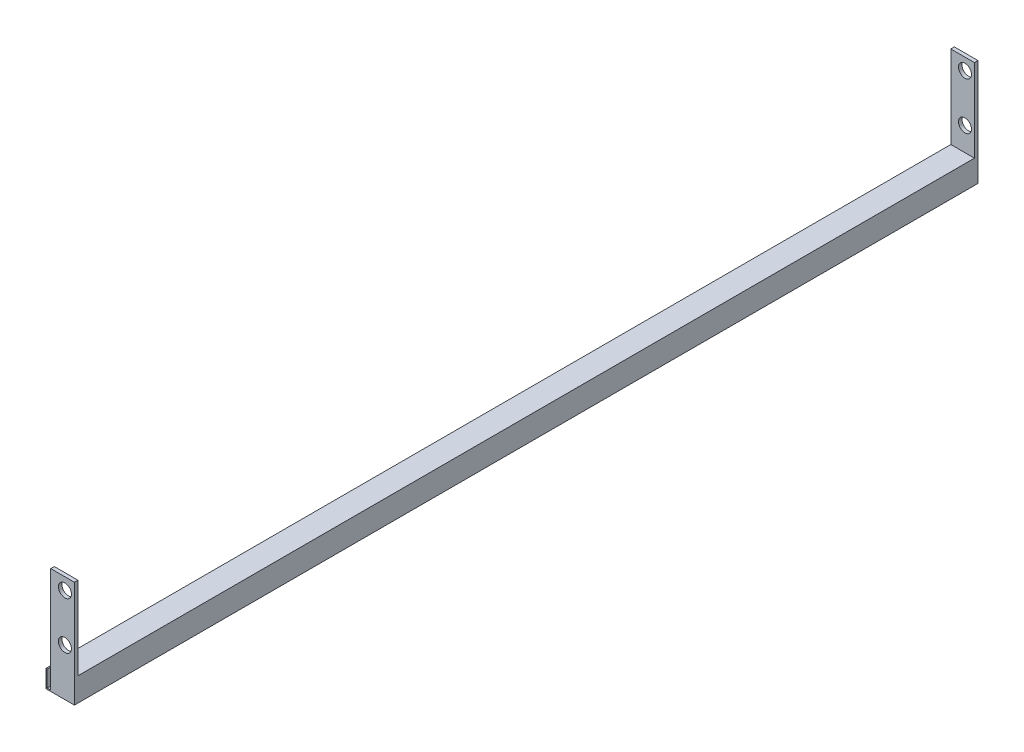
ISO-10303-21;
HEADER;
FILE_DESCRIPTION(('STEP AP214'),'2;1');
FILE_NAME('part.step','',(''),(''),'','','');
FILE_SCHEMA(('AUTOMOTIVE_DESIGN { 1 0 10303 214 1 1 1 1 }'));
ENDSEC;
DATA;
#1=APPLICATION_CONTEXT('core data for automotive mechanical design processes');
#2=APPLICATION_PROTOCOL_DEFINITION('international standard','automotive_design',2000,#1);
#3=PRODUCT_CONTEXT('',#1,'mechanical');
#4=PRODUCT('Part','Part','',(#3));
#5=PRODUCT_RELATED_PRODUCT_CATEGORY('part','',(#4));
#6=PRODUCT_DEFINITION_FORMATION('','',#4);
#7=PRODUCT_DEFINITION_CONTEXT('part definition',#1,'design');
#8=PRODUCT_DEFINITION('design','',#6,#7);
#9=PRODUCT_DEFINITION_SHAPE('','',#8);
#10=(LENGTH_UNIT() NAMED_UNIT(*) SI_UNIT(.MILLI.,.METRE.));
#11=(NAMED_UNIT(*) PLANE_ANGLE_UNIT() SI_UNIT($,.RADIAN.));
#12=(NAMED_UNIT(*) SI_UNIT($,.STERADIAN.) SOLID_ANGLE_UNIT());
#13=UNCERTAINTY_MEASURE_WITH_UNIT(LENGTH_MEASURE(1.E-05),#10,'distance_accuracy_value','');
#14=(GEOMETRIC_REPRESENTATION_CONTEXT(3) GLOBAL_UNCERTAINTY_ASSIGNED_CONTEXT((#13)) GLOBAL_UNIT_ASSIGNED_CONTEXT((#10,
#11,#12)) REPRESENTATION_CONTEXT('',''));
#15=CARTESIAN_POINT('',(0.,0.,0.));
#16=DIRECTION('',(0.,0.,1.));
#17=DIRECTION('',(1.,0.,0.));
#18=AXIS2_PLACEMENT_3D('',#15,#16,#17);
#19=CARTESIAN_POINT('',(0.,0.,758.));
#20=DIRECTION('',(1.,0.,0.));
#21=DIRECTION('',(0.,0.,-1.));
#22=AXIS2_PLACEMENT_3D('',#19,#20,#21);
#23=PLANE('',#22);
#24=DIRECTION('',(0.,0.,-1.));
#25=VECTOR('',#24,1.);
#26=CARTESIAN_POINT('',(0.,1.,776.52417469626));
#27=LINE('',#26,#25);
#28=CARTESIAN_POINT('',(0.,0.999999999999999,761.));
#29=VERTEX_POINT('',#28);
#30=CARTESIAN_POINT('',(0.,1.,-3.));
#31=VERTEX_POINT('',#30);
#32=EDGE_CURVE('E44',#29,#31,#27,.T.);
#33=ORIENTED_EDGE('',*,*,#32,.F.);
#34=DIRECTION('',(0.,-1.,0.));
#35=VECTOR('',#34,1.);
#36=CARTESIAN_POINT('',(0.,0.,761.));
#37=LINE('',#36,#35);
#38=CARTESIAN_POINT('',(0.,90.,761.));
#39=VERTEX_POINT('',#38);
#40=EDGE_CURVE('E155',#39,#29,#37,.T.);
#41=ORIENTED_EDGE('',*,*,#40,.F.);
#42=DIRECTION('',(0.,0.,-1.));
#43=VECTOR('',#42,1.);
#44=CARTESIAN_POINT('',(0.,90.,761.));
#45=LINE('',#44,#43);
#46=CARTESIAN_POINT('',(0.,90.,758.));
#47=VERTEX_POINT('',#46);
#48=EDGE_CURVE('E154',#39,#47,#45,.T.);
#49=ORIENTED_EDGE('',*,*,#48,.T.);
#50=DIRECTION('',(0.,-1.,0.));
#51=VECTOR('',#50,1.);
#52=CARTESIAN_POINT('',(0.,0.,758.));
#53=LINE('',#52,#51);
#54=CARTESIAN_POINT('',(0.,20.,758.));
#55=VERTEX_POINT('',#54);
#56=EDGE_CURVE('E223',#47,#55,#53,.T.);
#57=ORIENTED_EDGE('',*,*,#56,.T.);
#58=DIRECTION('',(0.,0.,-1.));
#59=VECTOR('',#58,1.);
#60=CARTESIAN_POINT('',(0.,20.,758.));
#61=LINE('',#60,#59);
#62=CARTESIAN_POINT('',(0.,20.,0.));
#63=VERTEX_POINT('',#62);
#64=EDGE_CURVE('E286',#55,#63,#61,.T.);
#65=ORIENTED_EDGE('',*,*,#64,.T.);
#66=DIRECTION('',(0.,1.,0.));
#67=VECTOR('',#66,1.);
#68=CARTESIAN_POINT('',(0.,0.,0.));
#69=LINE('',#68,#67);
#70=CARTESIAN_POINT('',(0.,90.,0.));
#71=VERTEX_POINT('',#70);
#72=EDGE_CURVE('E190',#63,#71,#69,.T.);
#73=ORIENTED_EDGE('',*,*,#72,.T.);
#74=DIRECTION('',(0.,0.,1.));
#75=VECTOR('',#74,1.);
#76=CARTESIAN_POINT('',(0.,90.,-3.));
#77=LINE('',#76,#75);
#78=CARTESIAN_POINT('',(0.,90.,-3.));
#79=VERTEX_POINT('',#78);
#80=EDGE_CURVE('E204',#79,#71,#77,.T.);
#81=ORIENTED_EDGE('',*,*,#80,.F.);
#82=DIRECTION('',(0.,1.,0.));
#83=VECTOR('',#82,1.);
#84=CARTESIAN_POINT('',(0.,0.,-3.));
#85=LINE('',#84,#83);
#86=EDGE_CURVE('E237',#31,#79,#85,.T.);
#87=ORIENTED_EDGE('',*,*,#86,.F.);
#88=EDGE_LOOP('',(#33,#41,#49,#57,#65,#73,#81,#87));
#89=FACE_BOUND('',#88,.T.);
#90=ADVANCED_FACE('F27',(#89),#23,.F.);
#91=CARTESIAN_POINT('',(0.,0.,758.));
#92=DIRECTION('',(0.,1.,0.));
#93=DIRECTION('',(0.,0.,1.));
#94=AXIS2_PLACEMENT_3D('',#91,#92,#93);
#95=PLANE('',#94);
#96=DIRECTION('',(1.,0.,0.));
#97=VECTOR('',#96,1.);
#98=CARTESIAN_POINT('',(20.,0.,761.));
#99=LINE('',#98,#97);
#100=CARTESIAN_POINT('',(-4.,0.,761.));
#101=VERTEX_POINT('',#100);
#102=CARTESIAN_POINT('',(20.,0.,761.));
#103=VERTEX_POINT('',#102);
#104=EDGE_CURVE('E144',#101,#103,#99,.T.);
#105=ORIENTED_EDGE('',*,*,#104,.F.);
#106=DIRECTION('',(0.,0.,-1.));
#107=VECTOR('',#106,1.);
#108=CARTESIAN_POINT('',(-4.,0.,776.52417469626));
#109=LINE('',#108,#107);
#110=CARTESIAN_POINT('',(-4.,0.,-3.));
#111=VERTEX_POINT('',#110);
#112=EDGE_CURVE('E149',#101,#111,#109,.T.);
#113=ORIENTED_EDGE('',*,*,#112,.T.);
#114=DIRECTION('',(-1.,0.,0.));
#115=VECTOR('',#114,1.);
#116=CARTESIAN_POINT('',(20.,0.,-3.));
#117=LINE('',#116,#115);
#118=CARTESIAN_POINT('',(20.,0.,-3.));
#119=VERTEX_POINT('',#118);
#120=EDGE_CURVE('E350',#119,#111,#117,.T.);
#121=ORIENTED_EDGE('',*,*,#120,.F.);
#122=DIRECTION('',(0.,0.,-1.));
#123=VECTOR('',#122,1.);
#124=CARTESIAN_POINT('',(20.,0.,758.));
#125=LINE('',#124,#123);
#126=EDGE_CURVE('E11',#103,#119,#125,.T.);
#127=ORIENTED_EDGE('',*,*,#126,.F.);
#128=EDGE_LOOP('',(#105,#113,#121,#127));
#129=FACE_BOUND('',#128,.T.);
#130=ADVANCED_FACE('F146',(#129),#95,.F.);
#131=CARTESIAN_POINT('',(20.,0.,758.));
#132=DIRECTION('',(-1.,0.,0.));
#133=DIRECTION('',(0.,0.,1.));
#134=AXIS2_PLACEMENT_3D('',#131,#132,#133);
#135=PLANE('',#134);
#136=ORIENTED_EDGE('',*,*,#126,.T.);
#137=DIRECTION('',(0.,-1.,0.));
#138=VECTOR('',#137,1.);
#139=CARTESIAN_POINT('',(20.,90.,-3.));
#140=LINE('',#139,#138);
#141=CARTESIAN_POINT('',(20.,90.,-3.));
#142=VERTEX_POINT('',#141);
#143=EDGE_CURVE('E357',#142,#119,#140,.T.);
#144=ORIENTED_EDGE('',*,*,#143,.F.);
#145=DIRECTION('',(0.,0.,1.));
#146=VECTOR('',#145,1.);
#147=CARTESIAN_POINT('',(20.,90.,-3.));
#148=LINE('',#147,#146);
#149=CARTESIAN_POINT('',(20.,90.,0.));
#150=VERTEX_POINT('',#149);
#151=EDGE_CURVE('E347',#142,#150,#148,.T.);
#152=ORIENTED_EDGE('',*,*,#151,.T.);
#153=DIRECTION('',(0.,-1.,0.));
#154=VECTOR('',#153,1.);
#155=CARTESIAN_POINT('',(20.,90.,0.));
#156=LINE('',#155,#154);
#157=CARTESIAN_POINT('',(20.,20.0000000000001,0.));
#158=VERTEX_POINT('',#157);
#159=EDGE_CURVE('E198',#150,#158,#156,.T.);
#160=ORIENTED_EDGE('',*,*,#159,.T.);
#161=DIRECTION('',(0.,0.,-1.));
#162=VECTOR('',#161,1.);
#163=CARTESIAN_POINT('',(20.,20.,758.));
#164=LINE('',#163,#162);
#165=CARTESIAN_POINT('',(20.,20.,758.));
#166=VERTEX_POINT('',#165);
#167=EDGE_CURVE('E36',#166,#158,#164,.T.);
#168=ORIENTED_EDGE('',*,*,#167,.F.);
#169=DIRECTION('',(0.,1.,0.));
#170=VECTOR('',#169,1.);
#171=CARTESIAN_POINT('',(20.,0.,758.));
#172=LINE('',#171,#170);
#173=CARTESIAN_POINT('',(20.,90.,758.));
#174=VERTEX_POINT('',#173);
#175=EDGE_CURVE('E213',#166,#174,#172,.T.);
#176=ORIENTED_EDGE('',*,*,#175,.T.);
#177=DIRECTION('',(0.,0.,-1.));
#178=VECTOR('',#177,1.);
#179=CARTESIAN_POINT('',(20.,90.,761.));
#180=LINE('',#179,#178);
#181=CARTESIAN_POINT('',(20.,90.,761.));
#182=VERTEX_POINT('',#181);
#183=EDGE_CURVE('E221',#182,#174,#180,.T.);
#184=ORIENTED_EDGE('',*,*,#183,.F.);
#185=DIRECTION('',(0.,1.,0.));
#186=VECTOR('',#185,1.);
#187=CARTESIAN_POINT('',(20.,0.,761.));
#188=LINE('',#187,#186);
#189=EDGE_CURVE('E226',#103,#182,#188,.T.);
#190=ORIENTED_EDGE('',*,*,#189,.F.);
#191=EDGE_LOOP('',(#136,#144,#152,#160,#168,#176,#184,#190));
#192=FACE_BOUND('',#191,.T.);
#193=ADVANCED_FACE('F333',(#192),#135,.F.);
#194=CARTESIAN_POINT('',(0.,20.,758.));
#195=DIRECTION('',(0.,-1.,0.));
#196=DIRECTION('',(0.,0.,-1.));
#197=AXIS2_PLACEMENT_3D('',#194,#195,#196);
#198=PLANE('',#197);
#199=DIRECTION('',(-1.,0.,0.));
#200=VECTOR('',#199,1.);
#201=CARTESIAN_POINT('',(0.,20.,0.));
#202=LINE('',#201,#200);
#203=EDGE_CURVE('E287',#158,#63,#202,.T.);
#204=ORIENTED_EDGE('',*,*,#203,.T.);
#205=ORIENTED_EDGE('',*,*,#64,.F.);
#206=DIRECTION('',(-1.,0.,0.));
#207=VECTOR('',#206,1.);
#208=CARTESIAN_POINT('',(0.,20.,758.));
#209=LINE('',#208,#207);
#210=EDGE_CURVE('E283',#166,#55,#209,.T.);
#211=ORIENTED_EDGE('',*,*,#210,.F.);
#212=ORIENTED_EDGE('',*,*,#167,.T.);
#213=EDGE_LOOP('',(#204,#205,#211,#212));
#214=FACE_BOUND('',#213,.T.);
#215=ADVANCED_FACE('F337',(#214),#198,.F.);
#216=CARTESIAN_POINT('',(20.,90.,758.));
#217=DIRECTION('',(0.,0.,1.));
#218=DIRECTION('',(1.,0.,0.));
#219=AXIS2_PLACEMENT_3D('',#216,#217,#218);
#220=PLANE('',#219);
#221=CARTESIAN_POINT('',(12.,80.,758.));
#222=DIRECTION('',(0.,0.,1.));
#223=DIRECTION('',(1.,0.,0.));
#224=AXIS2_PLACEMENT_3D('',#221,#222,#223);
#225=CIRCLE('',#224,5.5);
#226=CARTESIAN_POINT('',(17.5,80.,758.));
#227=VERTEX_POINT('',#226);
#228=EDGE_CURVE('E207',#227,#227,#225,.T.);
#229=ORIENTED_EDGE('',*,*,#228,.T.);
#230=EDGE_LOOP('',(#229));
#231=FACE_BOUND('',#230,.T.);
#232=CARTESIAN_POINT('',(12.,40.,758.));
#233=DIRECTION('',(0.,0.,1.));
#234=DIRECTION('',(1.,0.,0.));
#235=AXIS2_PLACEMENT_3D('',#232,#233,#234);
#236=CIRCLE('',#235,5.5);
#237=CARTESIAN_POINT('',(17.5,40.,758.));
#238=VERTEX_POINT('',#237);
#239=EDGE_CURVE('E200',#238,#238,#236,.T.);
#240=ORIENTED_EDGE('',*,*,#239,.T.);
#241=EDGE_LOOP('',(#240));
#242=FACE_BOUND('',#241,.T.);
#243=ORIENTED_EDGE('',*,*,#175,.F.);
#244=ORIENTED_EDGE('',*,*,#210,.T.);
#245=ORIENTED_EDGE('',*,*,#56,.F.);
#246=DIRECTION('',(-1.,0.,0.));
#247=VECTOR('',#246,1.);
#248=CARTESIAN_POINT('',(20.,90.,758.));
#249=LINE('',#248,#247);
#250=EDGE_CURVE('E216',#174,#47,#249,.T.);
#251=ORIENTED_EDGE('',*,*,#250,.F.);
#252=EDGE_LOOP('',(#243,#244,#245,#251));
#253=FACE_BOUND('',#252,.T.);
#254=ADVANCED_FACE('F280',(#231,#242,#253),#220,.F.);
#255=CARTESIAN_POINT('',(20.,90.,761.));
#256=DIRECTION('',(0.,0.,1.));
#257=DIRECTION('',(1.,0.,0.));
#258=AXIS2_PLACEMENT_3D('',#255,#256,#257);
#259=PLANE('',#258);
#260=CARTESIAN_POINT('',(12.,80.,761.));
#261=DIRECTION('',(0.,0.,1.));
#262=DIRECTION('',(1.,0.,0.));
#263=AXIS2_PLACEMENT_3D('',#260,#261,#262);
#264=CIRCLE('',#263,5.5);
#265=CARTESIAN_POINT('',(17.5,80.,761.));
#266=VERTEX_POINT('',#265);
#267=EDGE_CURVE('E210',#266,#266,#264,.T.);
#268=ORIENTED_EDGE('',*,*,#267,.F.);
#269=EDGE_LOOP('',(#268));
#270=FACE_BOUND('',#269,.T.);
#271=ORIENTED_EDGE('',*,*,#189,.T.);
#272=DIRECTION('',(-1.,0.,0.));
#273=VECTOR('',#272,1.);
#274=CARTESIAN_POINT('',(20.,90.,761.));
#275=LINE('',#274,#273);
#276=EDGE_CURVE('E231',#182,#39,#275,.T.);
#277=ORIENTED_EDGE('',*,*,#276,.T.);
#278=ORIENTED_EDGE('',*,*,#40,.T.);
#279=DIRECTION('',(1.,0.,0.));
#280=VECTOR('',#279,1.);
#281=CARTESIAN_POINT('',(0.,1.,761.));
#282=LINE('',#281,#280);
#283=CARTESIAN_POINT('',(-3.,1.,761.));
#284=VERTEX_POINT('',#283);
#285=EDGE_CURVE('E241',#284,#29,#282,.T.);
#286=ORIENTED_EDGE('',*,*,#285,.F.);
#287=DIRECTION('',(0.,-1.,0.));
#288=VECTOR('',#287,1.);
#289=CARTESIAN_POINT('',(-3.,1.,761.));
#290=LINE('',#289,#288);
#291=CARTESIAN_POINT('',(-3.,15.,761.));
#292=VERTEX_POINT('',#291);
#293=EDGE_CURVE('E247',#292,#284,#290,.T.);
#294=ORIENTED_EDGE('',*,*,#293,.F.);
#295=DIRECTION('',(1.,0.,0.));
#296=VECTOR('',#295,1.);
#297=CARTESIAN_POINT('',(-3.,15.,761.));
#298=LINE('',#297,#296);
#299=CARTESIAN_POINT('',(-4.,15.,761.));
#300=VERTEX_POINT('',#299);
#301=EDGE_CURVE('E162',#300,#292,#298,.T.);
#302=ORIENTED_EDGE('',*,*,#301,.F.);
#303=DIRECTION('',(0.,1.,0.));
#304=VECTOR('',#303,1.);
#305=CARTESIAN_POINT('',(-4.,0.,761.));
#306=LINE('',#305,#304);
#307=EDGE_CURVE('E158',#101,#300,#306,.T.);
#308=ORIENTED_EDGE('',*,*,#307,.F.);
#309=ORIENTED_EDGE('',*,*,#104,.T.);
#310=EDGE_LOOP('',(#271,#277,#278,#286,#294,#302,#308,#309));
#311=FACE_BOUND('',#310,.T.);
#312=CARTESIAN_POINT('',(12.,40.,761.));
#313=DIRECTION('',(0.,0.,1.));
#314=DIRECTION('',(1.,0.,0.));
#315=AXIS2_PLACEMENT_3D('',#312,#313,#314);
#316=CIRCLE('',#315,5.5);
#317=CARTESIAN_POINT('',(17.5,40.,761.));
#318=VERTEX_POINT('',#317);
#319=EDGE_CURVE('E203',#318,#318,#316,.T.);
#320=ORIENTED_EDGE('',*,*,#319,.F.);
#321=EDGE_LOOP('',(#320));
#322=FACE_BOUND('',#321,.T.);
#323=ADVANCED_FACE('F159',(#270,#311,#322),#259,.T.);
#324=CARTESIAN_POINT('',(20.,90.,761.));
#325=DIRECTION('',(0.,-1.,0.));
#326=DIRECTION('',(0.,0.,-1.));
#327=AXIS2_PLACEMENT_3D('',#324,#325,#326);
#328=PLANE('',#327);
#329=ORIENTED_EDGE('',*,*,#250,.T.);
#330=ORIENTED_EDGE('',*,*,#48,.F.);
#331=ORIENTED_EDGE('',*,*,#276,.F.);
#332=ORIENTED_EDGE('',*,*,#183,.T.);
#333=EDGE_LOOP('',(#329,#330,#331,#332));
#334=FACE_BOUND('',#333,.T.);
#335=ADVANCED_FACE('F331',(#334),#328,.F.);
#336=CARTESIAN_POINT('',(12.,80.,761.));
#337=DIRECTION('',(0.,0.,-1.));
#338=DIRECTION('',(-1.,0.,0.));
#339=AXIS2_PLACEMENT_3D('',#336,#337,#338);
#340=CYLINDRICAL_SURFACE('',#339,5.5);
#341=ORIENTED_EDGE('',*,*,#267,.T.);
#342=EDGE_LOOP('',(#341));
#343=FACE_BOUND('',#342,.T.);
#344=ORIENTED_EDGE('',*,*,#228,.F.);
#345=EDGE_LOOP('',(#344));
#346=FACE_BOUND('',#345,.T.);
#347=ADVANCED_FACE('F412',(#343,#346),#340,.F.);
#348=CARTESIAN_POINT('',(12.,40.,761.));
#349=DIRECTION('',(0.,0.,-1.));
#350=DIRECTION('',(-1.,0.,0.));
#351=AXIS2_PLACEMENT_3D('',#348,#349,#350);
#352=CYLINDRICAL_SURFACE('',#351,5.5);
#353=ORIENTED_EDGE('',*,*,#319,.T.);
#354=EDGE_LOOP('',(#353));
#355=FACE_BOUND('',#354,.T.);
#356=ORIENTED_EDGE('',*,*,#239,.F.);
#357=EDGE_LOOP('',(#356));
#358=FACE_BOUND('',#357,.T.);
#359=ADVANCED_FACE('F420',(#355,#358),#352,.F.);
#360=CARTESIAN_POINT('',(0.,0.,-3.));
#361=DIRECTION('',(0.,0.,-1.));
#362=DIRECTION('',(-1.,0.,0.));
#363=AXIS2_PLACEMENT_3D('',#360,#361,#362);
#364=PLANE('',#363);
#365=CARTESIAN_POINT('',(12.,40.,-3.));
#366=DIRECTION('',(0.,0.,-1.));
#367=DIRECTION('',(-1.,0.,0.));
#368=AXIS2_PLACEMENT_3D('',#365,#366,#367);
#369=CIRCLE('',#368,5.5);
#370=CARTESIAN_POINT('',(6.50000000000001,40.,-3.));
#371=VERTEX_POINT('',#370);
#372=EDGE_CURVE('E187',#371,#371,#369,.T.);
#373=ORIENTED_EDGE('',*,*,#372,.F.);
#374=EDGE_LOOP('',(#373));
#375=FACE_BOUND('',#374,.T.);
#376=ORIENTED_EDGE('',*,*,#120,.T.);
#377=DIRECTION('',(0.,1.,0.));
#378=VECTOR('',#377,1.);
#379=CARTESIAN_POINT('',(-4.,0.,-3.));
#380=LINE('',#379,#378);
#381=CARTESIAN_POINT('',(-4.,15.,-3.));
#382=VERTEX_POINT('',#381);
#383=EDGE_CURVE('E169',#111,#382,#380,.T.);
#384=ORIENTED_EDGE('',*,*,#383,.T.);
#385=DIRECTION('',(1.,0.,0.));
#386=VECTOR('',#385,1.);
#387=CARTESIAN_POINT('',(-3.,15.,-3.));
#388=LINE('',#387,#386);
#389=CARTESIAN_POINT('',(-3.,15.,-3.));
#390=VERTEX_POINT('',#389);
#391=EDGE_CURVE('E257',#382,#390,#388,.T.);
#392=ORIENTED_EDGE('',*,*,#391,.T.);
#393=DIRECTION('',(0.,-1.,0.));
#394=VECTOR('',#393,1.);
#395=CARTESIAN_POINT('',(-3.,1.,-3.));
#396=LINE('',#395,#394);
#397=CARTESIAN_POINT('',(-3.,1.,-3.));
#398=VERTEX_POINT('',#397);
#399=EDGE_CURVE('E173',#390,#398,#396,.T.);
#400=ORIENTED_EDGE('',*,*,#399,.T.);
#401=DIRECTION('',(1.,0.,0.));
#402=VECTOR('',#401,1.);
#403=CARTESIAN_POINT('',(0.,1.,-3.));
#404=LINE('',#403,#402);
#405=EDGE_CURVE('E170',#398,#31,#404,.T.);
#406=ORIENTED_EDGE('',*,*,#405,.T.);
#407=ORIENTED_EDGE('',*,*,#86,.T.);
#408=DIRECTION('',(1.,0.,0.));
#409=VECTOR('',#408,1.);
#410=CARTESIAN_POINT('',(0.,90.,-3.));
#411=LINE('',#410,#409);
#412=EDGE_CURVE('E346',#79,#142,#411,.T.);
#413=ORIENTED_EDGE('',*,*,#412,.T.);
#414=ORIENTED_EDGE('',*,*,#143,.T.);
#415=EDGE_LOOP('',(#376,#384,#392,#400,#406,#407,#413,#414));
#416=FACE_BOUND('',#415,.T.);
#417=CARTESIAN_POINT('',(12.,80.,-3.));
#418=DIRECTION('',(0.,0.,-1.));
#419=DIRECTION('',(-1.,0.,0.));
#420=AXIS2_PLACEMENT_3D('',#417,#418,#419);
#421=CIRCLE('',#420,5.50000000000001);
#422=CARTESIAN_POINT('',(6.49999999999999,80.,-3.));
#423=VERTEX_POINT('',#422);
#424=EDGE_CURVE('E181',#423,#423,#421,.T.);
#425=ORIENTED_EDGE('',*,*,#424,.F.);
#426=EDGE_LOOP('',(#425));
#427=FACE_BOUND('',#426,.T.);
#428=ADVANCED_FACE('F263',(#375,#416,#427),#364,.T.);
#429=CARTESIAN_POINT('',(0.,0.,0.));
#430=DIRECTION('',(0.,0.,-1.));
#431=DIRECTION('',(-1.,0.,0.));
#432=AXIS2_PLACEMENT_3D('',#429,#430,#431);
#433=PLANE('',#432);
#434=ORIENTED_EDGE('',*,*,#203,.F.);
#435=ORIENTED_EDGE('',*,*,#159,.F.);
#436=DIRECTION('',(1.,0.,0.));
#437=VECTOR('',#436,1.);
#438=CARTESIAN_POINT('',(0.,90.,0.));
#439=LINE('',#438,#437);
#440=EDGE_CURVE('E193',#71,#150,#439,.T.);
#441=ORIENTED_EDGE('',*,*,#440,.F.);
#442=ORIENTED_EDGE('',*,*,#72,.F.);
#443=EDGE_LOOP('',(#434,#435,#441,#442));
#444=FACE_BOUND('',#443,.T.);
#445=CARTESIAN_POINT('',(12.,40.,0.));
#446=DIRECTION('',(0.,0.,-1.));
#447=DIRECTION('',(-1.,0.,0.));
#448=AXIS2_PLACEMENT_3D('',#445,#446,#447);
#449=CIRCLE('',#448,5.5);
#450=CARTESIAN_POINT('',(6.50000000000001,40.,0.));
#451=VERTEX_POINT('',#450);
#452=EDGE_CURVE('E184',#451,#451,#449,.T.);
#453=ORIENTED_EDGE('',*,*,#452,.T.);
#454=EDGE_LOOP('',(#453));
#455=FACE_BOUND('',#454,.T.);
#456=CARTESIAN_POINT('',(12.,80.,0.));
#457=DIRECTION('',(0.,0.,-1.));
#458=DIRECTION('',(-1.,0.,0.));
#459=AXIS2_PLACEMENT_3D('',#456,#457,#458);
#460=CIRCLE('',#459,5.50000000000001);
#461=CARTESIAN_POINT('',(6.49999999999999,80.,0.));
#462=VERTEX_POINT('',#461);
#463=EDGE_CURVE('E178',#462,#462,#460,.T.);
#464=ORIENTED_EDGE('',*,*,#463,.T.);
#465=EDGE_LOOP('',(#464));
#466=FACE_BOUND('',#465,.T.);
#467=ADVANCED_FACE('F348',(#444,#455,#466),#433,.F.);
#468=CARTESIAN_POINT('',(0.,90.,-3.));
#469=DIRECTION('',(0.,-1.,0.));
#470=DIRECTION('',(0.,0.,-1.));
#471=AXIS2_PLACEMENT_3D('',#468,#469,#470);
#472=PLANE('',#471);
#473=ORIENTED_EDGE('',*,*,#440,.T.);
#474=ORIENTED_EDGE('',*,*,#151,.F.);
#475=ORIENTED_EDGE('',*,*,#412,.F.);
#476=ORIENTED_EDGE('',*,*,#80,.T.);
#477=EDGE_LOOP('',(#473,#474,#475,#476));
#478=FACE_BOUND('',#477,.T.);
#479=ADVANCED_FACE('F344',(#478),#472,.F.);
#480=CARTESIAN_POINT('',(12.,40.,-3.));
#481=DIRECTION('',(0.,0.,1.));
#482=DIRECTION('',(1.,0.,0.));
#483=AXIS2_PLACEMENT_3D('',#480,#481,#482);
#484=CYLINDRICAL_SURFACE('',#483,5.5);
#485=ORIENTED_EDGE('',*,*,#372,.T.);
#486=EDGE_LOOP('',(#485));
#487=FACE_BOUND('',#486,.T.);
#488=ORIENTED_EDGE('',*,*,#452,.F.);
#489=EDGE_LOOP('',(#488));
#490=FACE_BOUND('',#489,.T.);
#491=ADVANCED_FACE('F369',(#487,#490),#484,.F.);
#492=CARTESIAN_POINT('',(12.,80.,-3.));
#493=DIRECTION('',(0.,0.,1.));
#494=DIRECTION('',(1.,0.,0.));
#495=AXIS2_PLACEMENT_3D('',#492,#493,#494);
#496=CYLINDRICAL_SURFACE('',#495,5.50000000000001);
#497=ORIENTED_EDGE('',*,*,#424,.T.);
#498=EDGE_LOOP('',(#497));
#499=FACE_BOUND('',#498,.T.);
#500=ORIENTED_EDGE('',*,*,#463,.F.);
#501=EDGE_LOOP('',(#500));
#502=FACE_BOUND('',#501,.T.);
#503=ADVANCED_FACE('F367',(#499,#502),#496,.F.);
#504=CARTESIAN_POINT('',(-4.,0.,776.52417469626));
#505=DIRECTION('',(-1.,0.,0.));
#506=DIRECTION('',(0.,0.,1.));
#507=AXIS2_PLACEMENT_3D('',#504,#505,#506);
#508=PLANE('',#507);
#509=ORIENTED_EDGE('',*,*,#112,.F.);
#510=ORIENTED_EDGE('',*,*,#307,.T.);
#511=DIRECTION('',(0.,0.,-1.));
#512=VECTOR('',#511,1.);
#513=CARTESIAN_POINT('',(-4.,15.,776.52417469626));
#514=LINE('',#513,#512);
#515=EDGE_CURVE('E165',#300,#382,#514,.T.);
#516=ORIENTED_EDGE('',*,*,#515,.T.);
#517=ORIENTED_EDGE('',*,*,#383,.F.);
#518=EDGE_LOOP('',(#509,#510,#516,#517));
#519=FACE_BOUND('',#518,.T.);
#520=ADVANCED_FACE('F167',(#519),#508,.T.);
#521=CARTESIAN_POINT('',(-3.,15.,776.52417469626));
#522=DIRECTION('',(0.,1.,0.));
#523=DIRECTION('',(0.,0.,1.));
#524=AXIS2_PLACEMENT_3D('',#521,#522,#523);
#525=PLANE('',#524);
#526=ORIENTED_EDGE('',*,*,#515,.F.);
#527=ORIENTED_EDGE('',*,*,#301,.T.);
#528=DIRECTION('',(0.,0.,-1.));
#529=VECTOR('',#528,1.);
#530=CARTESIAN_POINT('',(-3.,15.,776.52417469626));
#531=LINE('',#530,#529);
#532=EDGE_CURVE('E248',#292,#390,#531,.T.);
#533=ORIENTED_EDGE('',*,*,#532,.T.);
#534=ORIENTED_EDGE('',*,*,#391,.F.);
#535=EDGE_LOOP('',(#526,#527,#533,#534));
#536=FACE_BOUND('',#535,.T.);
#537=ADVANCED_FACE('F377',(#536),#525,.T.);
#538=CARTESIAN_POINT('',(-3.,1.,776.52417469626));
#539=DIRECTION('',(1.,0.,0.));
#540=DIRECTION('',(0.,0.,-1.));
#541=AXIS2_PLACEMENT_3D('',#538,#539,#540);
#542=PLANE('',#541);
#543=ORIENTED_EDGE('',*,*,#532,.F.);
#544=ORIENTED_EDGE('',*,*,#293,.T.);
#545=DIRECTION('',(0.,0.,-1.));
#546=VECTOR('',#545,1.);
#547=CARTESIAN_POINT('',(-3.,1.,776.52417469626));
#548=LINE('',#547,#546);
#549=EDGE_CURVE('E246',#284,#398,#548,.T.);
#550=ORIENTED_EDGE('',*,*,#549,.T.);
#551=ORIENTED_EDGE('',*,*,#399,.F.);
#552=EDGE_LOOP('',(#543,#544,#550,#551));
#553=FACE_BOUND('',#552,.T.);
#554=ADVANCED_FACE('F446',(#553),#542,.T.);
#555=CARTESIAN_POINT('',(0.,1.,776.52417469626));
#556=DIRECTION('',(0.,1.,0.));
#557=DIRECTION('',(0.,0.,1.));
#558=AXIS2_PLACEMENT_3D('',#555,#556,#557);
#559=PLANE('',#558);
#560=ORIENTED_EDGE('',*,*,#549,.F.);
#561=ORIENTED_EDGE('',*,*,#285,.T.);
#562=ORIENTED_EDGE('',*,*,#32,.T.);
#563=ORIENTED_EDGE('',*,*,#405,.F.);
#564=EDGE_LOOP('',(#560,#561,#562,#563));
#565=FACE_BOUND('',#564,.T.);
#566=ADVANCED_FACE('F268',(#565),#559,.T.);
#567=CLOSED_SHELL('',(#90,#130,#193,#215,#254,#323,#335,#347,#359,#428,#467,#479,#491,#503,#520,
#537,#554,#566));
#568=DIRECTION('',(-1.,0.,0.));
#569=VECTOR('',#568,1.);
#570=CARTESIAN_POINT('',(1.,19.,0.));
#571=LINE('',#570,#569);
#572=CARTESIAN_POINT('',(19.,19.,0.));
#573=VERTEX_POINT('',#572);
#574=CARTESIAN_POINT('',(1.,19.,0.));
#575=VERTEX_POINT('',#574);
#576=EDGE_CURVE('E325',#573,#575,#571,.T.);
#577=ORIENTED_EDGE('',*,*,#576,.T.);
#578=DIRECTION('',(0.,-1.,0.));
#579=VECTOR('',#578,1.);
#580=CARTESIAN_POINT('',(1.,1.,0.));
#581=LINE('',#580,#579);
#582=CARTESIAN_POINT('',(1.,1.,0.));
#583=VERTEX_POINT('',#582);
#584=EDGE_CURVE('E322',#575,#583,#581,.T.);
#585=ORIENTED_EDGE('',*,*,#584,.T.);
#586=DIRECTION('',(1.,0.,0.));
#587=VECTOR('',#586,1.);
#588=CARTESIAN_POINT('',(1.,1.,0.));
#589=LINE('',#588,#587);
#590=CARTESIAN_POINT('',(19.,1.,0.));
#591=VERTEX_POINT('',#590);
#592=EDGE_CURVE('E52',#583,#591,#589,.T.);
#593=ORIENTED_EDGE('',*,*,#592,.T.);
#594=DIRECTION('',(0.,1.,0.));
#595=VECTOR('',#594,1.);
#596=CARTESIAN_POINT('',(19.,1.,0.));
#597=LINE('',#596,#595);
#598=EDGE_CURVE('E327',#591,#573,#597,.T.);
#599=ORIENTED_EDGE('',*,*,#598,.T.);
#600=EDGE_LOOP('',(#577,#585,#593,#599));
#601=FACE_BOUND('',#600,.T.);
#602=ADVANCED_FACE('F362',(#601),#433,.F.);
#603=DIRECTION('',(1.,0.,0.));
#604=VECTOR('',#603,1.);
#605=CARTESIAN_POINT('',(1.,1.,758.));
#606=LINE('',#605,#604);
#607=CARTESIAN_POINT('',(1.,1.,758.));
#608=VERTEX_POINT('',#607);
#609=CARTESIAN_POINT('',(19.,1.,758.));
#610=VERTEX_POINT('',#609);
#611=EDGE_CURVE('E319',#608,#610,#606,.T.);
#612=ORIENTED_EDGE('',*,*,#611,.F.);
#613=DIRECTION('',(0.,-1.,0.));
#614=VECTOR('',#613,1.);
#615=CARTESIAN_POINT('',(1.,1.,758.));
#616=LINE('',#615,#614);
#617=CARTESIAN_POINT('',(1.,19.,758.));
#618=VERTEX_POINT('',#617);
#619=EDGE_CURVE('E310',#618,#608,#616,.T.);
#620=ORIENTED_EDGE('',*,*,#619,.F.);
#621=DIRECTION('',(-1.,0.,0.));
#622=VECTOR('',#621,1.);
#623=CARTESIAN_POINT('',(1.,19.,758.));
#624=LINE('',#623,#622);
#625=CARTESIAN_POINT('',(19.,19.,758.));
#626=VERTEX_POINT('',#625);
#627=EDGE_CURVE('E313',#626,#618,#624,.T.);
#628=ORIENTED_EDGE('',*,*,#627,.F.);
#629=DIRECTION('',(0.,1.,0.));
#630=VECTOR('',#629,1.);
#631=CARTESIAN_POINT('',(19.,1.,758.));
#632=LINE('',#631,#630);
#633=EDGE_CURVE('E316',#610,#626,#632,.T.);
#634=ORIENTED_EDGE('',*,*,#633,.F.);
#635=EDGE_LOOP('',(#612,#620,#628,#634));
#636=FACE_BOUND('',#635,.T.);
#637=ADVANCED_FACE('F406',(#636),#220,.F.);
#638=CARTESIAN_POINT('',(1.,19.,758.));
#639=DIRECTION('',(0.,-1.,0.));
#640=DIRECTION('',(0.,0.,-1.));
#641=AXIS2_PLACEMENT_3D('',#638,#639,#640);
#642=PLANE('',#641);
#643=ORIENTED_EDGE('',*,*,#576,.F.);
#644=DIRECTION('',(0.,0.,-1.));
#645=VECTOR('',#644,1.);
#646=CARTESIAN_POINT('',(19.,19.,758.));
#647=LINE('',#646,#645);
#648=EDGE_CURVE('E303',#626,#573,#647,.T.);
#649=ORIENTED_EDGE('',*,*,#648,.F.);
#650=ORIENTED_EDGE('',*,*,#627,.T.);
#651=DIRECTION('',(0.,0.,-1.));
#652=VECTOR('',#651,1.);
#653=CARTESIAN_POINT('',(1.,19.,758.));
#654=LINE('',#653,#652);
#655=EDGE_CURVE('E305',#618,#575,#654,.T.);
#656=ORIENTED_EDGE('',*,*,#655,.T.);
#657=EDGE_LOOP('',(#643,#649,#650,#656));
#658=FACE_BOUND('',#657,.T.);
#659=ADVANCED_FACE('F402',(#658),#642,.T.);
#660=CARTESIAN_POINT('',(19.,1.,758.));
#661=DIRECTION('',(-1.,0.,0.));
#662=DIRECTION('',(0.,0.,1.));
#663=AXIS2_PLACEMENT_3D('',#660,#661,#662);
#664=PLANE('',#663);
#665=ORIENTED_EDGE('',*,*,#598,.F.);
#666=DIRECTION('',(0.,0.,-1.));
#667=VECTOR('',#666,1.);
#668=CARTESIAN_POINT('',(19.,1.,758.));
#669=LINE('',#668,#667);
#670=EDGE_CURVE('E291',#610,#591,#669,.T.);
#671=ORIENTED_EDGE('',*,*,#670,.F.);
#672=ORIENTED_EDGE('',*,*,#633,.T.);
#673=ORIENTED_EDGE('',*,*,#648,.T.);
#674=EDGE_LOOP('',(#665,#671,#672,#673));
#675=FACE_BOUND('',#674,.T.);
#676=ADVANCED_FACE('F398',(#675),#664,.T.);
#677=CARTESIAN_POINT('',(1.,1.,758.));
#678=DIRECTION('',(0.,1.,0.));
#679=DIRECTION('',(0.,0.,1.));
#680=AXIS2_PLACEMENT_3D('',#677,#678,#679);
#681=PLANE('',#680);
#682=ORIENTED_EDGE('',*,*,#592,.F.);
#683=DIRECTION('',(0.,0.,-1.));
#684=VECTOR('',#683,1.);
#685=CARTESIAN_POINT('',(1.,1.,758.));
#686=LINE('',#685,#684);
#687=EDGE_CURVE('E308',#608,#583,#686,.T.);
#688=ORIENTED_EDGE('',*,*,#687,.F.);
#689=ORIENTED_EDGE('',*,*,#611,.T.);
#690=ORIENTED_EDGE('',*,*,#670,.T.);
#691=EDGE_LOOP('',(#682,#688,#689,#690));
#692=FACE_BOUND('',#691,.T.);
#693=ADVANCED_FACE('F394',(#692),#681,.T.);
#694=CARTESIAN_POINT('',(1.,1.,758.));
#695=DIRECTION('',(1.,0.,0.));
#696=DIRECTION('',(0.,0.,-1.));
#697=AXIS2_PLACEMENT_3D('',#694,#695,#696);
#698=PLANE('',#697);
#699=ORIENTED_EDGE('',*,*,#584,.F.);
#700=ORIENTED_EDGE('',*,*,#655,.F.);
#701=ORIENTED_EDGE('',*,*,#619,.T.);
#702=ORIENTED_EDGE('',*,*,#687,.T.);
#703=EDGE_LOOP('',(#699,#700,#701,#702));
#704=FACE_BOUND('',#703,.T.);
#705=ADVANCED_FACE('F397',(#704),#698,.T.);
#706=CLOSED_SHELL('',(#602,#637,#659,#676,#693,#705));
#707=ORIENTED_CLOSED_SHELL('',*,#706,.T.);
#708=BREP_WITH_VOIDS('B2',#567,(#707));
#709=ADVANCED_BREP_SHAPE_REPRESENTATION('',(#18,#708),#14);
#710=SHAPE_DEFINITION_REPRESENTATION(#9,#709);
ENDSEC;
END-ISO-10303-21;
